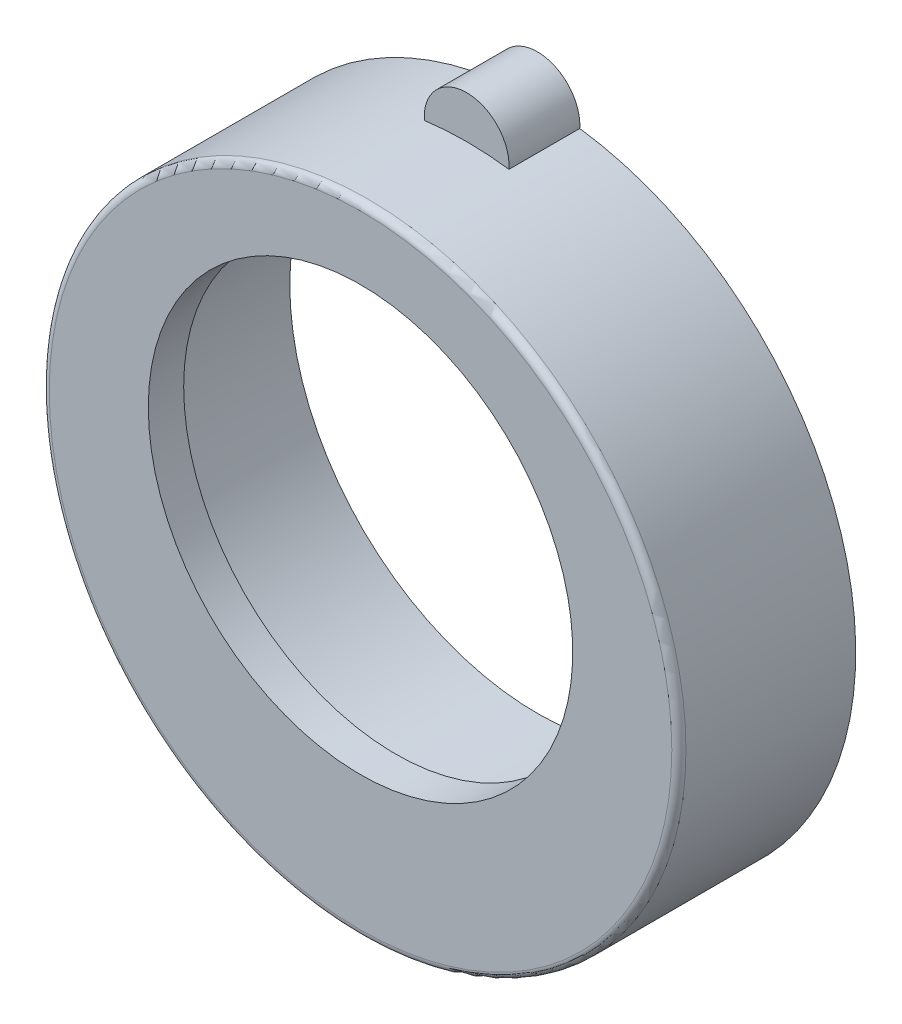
ISO-10303-21;
HEADER;
FILE_DESCRIPTION(('STEP AP214'),'2;1');
FILE_NAME('part.step','',(''),(''),'','','');
FILE_SCHEMA(('AUTOMOTIVE_DESIGN { 1 0 10303 214 1 1 1 1 }'));
ENDSEC;
DATA;
#1=APPLICATION_CONTEXT('core data for automotive mechanical design processes');
#2=APPLICATION_PROTOCOL_DEFINITION('international standard','automotive_design',2000,#1);
#3=PRODUCT_CONTEXT('',#1,'mechanical');
#4=PRODUCT('Part','Part','',(#3));
#5=PRODUCT_RELATED_PRODUCT_CATEGORY('part','',(#4));
#6=PRODUCT_DEFINITION_FORMATION('','',#4);
#7=PRODUCT_DEFINITION_CONTEXT('part definition',#1,'design');
#8=PRODUCT_DEFINITION('design','',#6,#7);
#9=PRODUCT_DEFINITION_SHAPE('','',#8);
#10=(LENGTH_UNIT() NAMED_UNIT(*) SI_UNIT(.MILLI.,.METRE.));
#11=(NAMED_UNIT(*) PLANE_ANGLE_UNIT() SI_UNIT($,.RADIAN.));
#12=(NAMED_UNIT(*) SI_UNIT($,.STERADIAN.) SOLID_ANGLE_UNIT());
#13=UNCERTAINTY_MEASURE_WITH_UNIT(LENGTH_MEASURE(1.E-05),#10,'distance_accuracy_value','');
#14=(GEOMETRIC_REPRESENTATION_CONTEXT(3) GLOBAL_UNCERTAINTY_ASSIGNED_CONTEXT((#13)) GLOBAL_UNIT_ASSIGNED_CONTEXT((#10,
#11,#12)) REPRESENTATION_CONTEXT('',''));
#15=CARTESIAN_POINT('',(0.,0.,0.));
#16=DIRECTION('',(0.,0.,1.));
#17=DIRECTION('',(1.,0.,0.));
#18=AXIS2_PLACEMENT_3D('',#15,#16,#17);
#19=CARTESIAN_POINT('',(0.,0.,5.));
#20=DIRECTION('',(0.,0.,-1.));
#21=DIRECTION('',(-1.,0.,0.));
#22=AXIS2_PLACEMENT_3D('',#19,#20,#21);
#23=CYLINDRICAL_SURFACE('',#22,9.);
#24=CARTESIAN_POINT('',(0.,0.,4.8));
#25=DIRECTION('',(0.,0.,1.));
#26=DIRECTION('',(1.,0.,0.));
#27=AXIS2_PLACEMENT_3D('',#24,#25,#26);
#28=CIRCLE('',#27,9.);
#29=CARTESIAN_POINT('',(9.,0.,4.8));
#30=VERTEX_POINT('',#29);
#31=EDGE_CURVE('E11',#30,#30,#28,.F.);
#32=ORIENTED_EDGE('',*,*,#31,.T.);
#33=EDGE_LOOP('',(#32));
#34=FACE_BOUND('',#33,.T.);
#35=CARTESIAN_POINT('',(0.,0.,0.));
#36=DIRECTION('',(0.,0.,1.));
#37=DIRECTION('',(1.,0.,0.));
#38=AXIS2_PLACEMENT_3D('',#35,#36,#37);
#39=CIRCLE('',#38,9.);
#40=CARTESIAN_POINT('',(-1.19733036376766,8.92,0.));
#41=VERTEX_POINT('',#40);
#42=CARTESIAN_POINT('',(1.19733036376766,8.92,0.));
#43=VERTEX_POINT('',#42);
#44=EDGE_CURVE('E377',#41,#43,#39,.T.);
#45=ORIENTED_EDGE('',*,*,#44,.T.);
#46=DIRECTION('',(0.,0.,-1.));
#47=VECTOR('',#46,1.);
#48=CARTESIAN_POINT('',(1.19733036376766,8.92,2.));
#49=LINE('',#48,#47);
#50=CARTESIAN_POINT('',(1.19733036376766,8.92,2.));
#51=VERTEX_POINT('',#50);
#52=EDGE_CURVE('E364',#51,#43,#49,.T.);
#53=ORIENTED_EDGE('',*,*,#52,.F.);
#54=CARTESIAN_POINT('',(0.,0.,2.));
#55=DIRECTION('',(0.,0.,1.));
#56=DIRECTION('',(-1.,0.,0.));
#57=AXIS2_PLACEMENT_3D('',#54,#55,#56);
#58=CIRCLE('',#57,9.);
#59=CARTESIAN_POINT('',(-1.19733036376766,8.92,2.));
#60=VERTEX_POINT('',#59);
#61=EDGE_CURVE('E369',#51,#60,#58,.T.);
#62=ORIENTED_EDGE('',*,*,#61,.T.);
#63=DIRECTION('',(0.,0.,-1.));
#64=VECTOR('',#63,1.);
#65=CARTESIAN_POINT('',(-1.19733036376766,8.92,2.));
#66=LINE('',#65,#64);
#67=EDGE_CURVE('E381',#60,#41,#66,.T.);
#68=ORIENTED_EDGE('',*,*,#67,.T.);
#69=EDGE_LOOP('',(#45,#53,#62,#68));
#70=FACE_BOUND('',#69,.T.);
#71=ADVANCED_FACE('F350',(#34,#70),#23,.T.);
#72=CARTESIAN_POINT('',(0.,0.,5.));
#73=DIRECTION('',(0.,0.,1.));
#74=DIRECTION('',(1.,0.,0.));
#75=AXIS2_PLACEMENT_3D('',#72,#73,#74);
#76=PLANE('',#75);
#77=CARTESIAN_POINT('',(0.,0.,5.));
#78=DIRECTION('',(0.,0.,1.));
#79=DIRECTION('',(1.,0.,0.));
#80=AXIS2_PLACEMENT_3D('',#77,#78,#79);
#81=CIRCLE('',#80,8.8);
#82=CARTESIAN_POINT('',(8.8,0.,5.));
#83=VERTEX_POINT('',#82);
#84=EDGE_CURVE('E357',#83,#83,#81,.T.);
#85=ORIENTED_EDGE('',*,*,#84,.T.);
#86=EDGE_LOOP('',(#85));
#87=FACE_BOUND('',#86,.T.);
#88=CARTESIAN_POINT('',(0.,1.,5.));
#89=DIRECTION('',(0.,0.,-1.));
#90=DIRECTION('',(-1.,0.,0.));
#91=AXIS2_PLACEMENT_3D('',#88,#89,#90);
#92=CIRCLE('',#91,6.);
#93=CARTESIAN_POINT('',(-6.,1.,5.));
#94=VERTEX_POINT('',#93);
#95=EDGE_CURVE('E448',#94,#94,#92,.T.);
#96=ORIENTED_EDGE('',*,*,#95,.T.);
#97=EDGE_LOOP('',(#96));
#98=FACE_BOUND('',#97,.T.);
#99=ADVANCED_FACE('F400',(#87,#98),#76,.T.);
#100=CARTESIAN_POINT('',(0.,0.,0.));
#101=DIRECTION('',(0.,0.,1.));
#102=DIRECTION('',(1.,0.,0.));
#103=AXIS2_PLACEMENT_3D('',#100,#101,#102);
#104=PLANE('',#103);
#105=CARTESIAN_POINT('',(0.,1.,0.));
#106=DIRECTION('',(0.,0.,-1.));
#107=DIRECTION('',(-1.,0.,0.));
#108=AXIS2_PLACEMENT_3D('',#105,#106,#107);
#109=CIRCLE('',#108,7.);
#110=CARTESIAN_POINT('',(-7.,1.,0.));
#111=VERTEX_POINT('',#110);
#112=EDGE_CURVE('E392',#111,#111,#109,.T.);
#113=ORIENTED_EDGE('',*,*,#112,.F.);
#114=EDGE_LOOP('',(#113));
#115=FACE_BOUND('',#114,.T.);
#116=ORIENTED_EDGE('',*,*,#44,.F.);
#117=CARTESIAN_POINT('',(0.,9.,0.));
#118=DIRECTION('',(0.,0.,-1.));
#119=DIRECTION('',(-1.,0.,0.));
#120=AXIS2_PLACEMENT_3D('',#117,#118,#119);
#121=CIRCLE('',#120,1.2);
#122=EDGE_CURVE('E380',#41,#43,#121,.T.);
#123=ORIENTED_EDGE('',*,*,#122,.T.);
#124=EDGE_LOOP('',(#116,#123));
#125=FACE_BOUND('',#124,.T.);
#126=ADVANCED_FACE('F378',(#115,#125),#104,.F.);
#127=CARTESIAN_POINT('',(0.,9.,2.));
#128=DIRECTION('',(0.,0.,-1.));
#129=DIRECTION('',(-1.,0.,0.));
#130=AXIS2_PLACEMENT_3D('',#127,#128,#129);
#131=CYLINDRICAL_SURFACE('',#130,1.2);
#132=ORIENTED_EDGE('',*,*,#122,.F.);
#133=ORIENTED_EDGE('',*,*,#67,.F.);
#134=CARTESIAN_POINT('',(0.,9.,2.));
#135=DIRECTION('',(0.,0.,-1.));
#136=DIRECTION('',(-1.,0.,0.));
#137=AXIS2_PLACEMENT_3D('',#134,#135,#136);
#138=CIRCLE('',#137,1.2);
#139=EDGE_CURVE('E387',#60,#51,#138,.T.);
#140=ORIENTED_EDGE('',*,*,#139,.T.);
#141=ORIENTED_EDGE('',*,*,#52,.T.);
#142=EDGE_LOOP('',(#132,#133,#140,#141));
#143=FACE_BOUND('',#142,.T.);
#144=ADVANCED_FACE('F386',(#143),#131,.T.);
#145=CARTESIAN_POINT('',(0.,4.5,2.));
#146=DIRECTION('',(0.,0.,-1.));
#147=DIRECTION('',(-1.,0.,0.));
#148=AXIS2_PLACEMENT_3D('',#145,#146,#147);
#149=PLANE('',#148);
#150=ORIENTED_EDGE('',*,*,#139,.F.);
#151=ORIENTED_EDGE('',*,*,#61,.F.);
#152=EDGE_LOOP('',(#150,#151));
#153=FACE_BOUND('',#152,.T.);
#154=ADVANCED_FACE('F428',(#153),#149,.F.);
#155=CARTESIAN_POINT('',(0.,1.,4.));
#156=DIRECTION('',(0.,0.,-1.));
#157=DIRECTION('',(-1.,0.,0.));
#158=AXIS2_PLACEMENT_3D('',#155,#156,#157);
#159=CYLINDRICAL_SURFACE('',#158,7.);
#160=CARTESIAN_POINT('',(0.,1.,4.));
#161=DIRECTION('',(0.,0.,-1.));
#162=DIRECTION('',(-1.,0.,0.));
#163=AXIS2_PLACEMENT_3D('',#160,#161,#162);
#164=CIRCLE('',#163,7.);
#165=CARTESIAN_POINT('',(-7.,1.,4.));
#166=VERTEX_POINT('',#165);
#167=EDGE_CURVE('E388',#166,#166,#164,.T.);
#168=ORIENTED_EDGE('',*,*,#167,.F.);
#169=EDGE_LOOP('',(#168));
#170=FACE_BOUND('',#169,.T.);
#171=ORIENTED_EDGE('',*,*,#112,.T.);
#172=EDGE_LOOP('',(#171));
#173=FACE_BOUND('',#172,.T.);
#174=ADVANCED_FACE('F431',(#170,#173),#159,.F.);
#175=CARTESIAN_POINT('',(0.,1.,4.));
#176=DIRECTION('',(0.,0.,-1.));
#177=DIRECTION('',(-1.,0.,0.));
#178=AXIS2_PLACEMENT_3D('',#175,#176,#177);
#179=PLANE('',#178);
#180=CARTESIAN_POINT('',(0.,1.,4.));
#181=DIRECTION('',(0.,0.,-1.));
#182=DIRECTION('',(-1.,0.,0.));
#183=AXIS2_PLACEMENT_3D('',#180,#181,#182);
#184=CIRCLE('',#183,6.);
#185=CARTESIAN_POINT('',(-6.,1.,4.));
#186=VERTEX_POINT('',#185);
#187=EDGE_CURVE('E443',#186,#186,#184,.T.);
#188=ORIENTED_EDGE('',*,*,#187,.F.);
#189=EDGE_LOOP('',(#188));
#190=FACE_BOUND('',#189,.T.);
#191=ORIENTED_EDGE('',*,*,#167,.T.);
#192=EDGE_LOOP('',(#191));
#193=FACE_BOUND('',#192,.T.);
#194=ADVANCED_FACE('F411',(#190,#193),#179,.T.);
#195=CARTESIAN_POINT('',(0.,1.,5.));
#196=DIRECTION('',(0.,0.,-1.));
#197=DIRECTION('',(-1.,0.,0.));
#198=AXIS2_PLACEMENT_3D('',#195,#196,#197);
#199=CYLINDRICAL_SURFACE('',#198,6.);
#200=ORIENTED_EDGE('',*,*,#95,.F.);
#201=EDGE_LOOP('',(#200));
#202=FACE_BOUND('',#201,.T.);
#203=ORIENTED_EDGE('',*,*,#187,.T.);
#204=EDGE_LOOP('',(#203));
#205=FACE_BOUND('',#204,.T.);
#206=ADVANCED_FACE('F405',(#202,#205),#199,.F.);
#207=CARTESIAN_POINT('',(0.,0.,4.8));
#208=DIRECTION('',(0.,0.,1.));
#209=DIRECTION('',(1.,0.,0.));
#210=AXIS2_PLACEMENT_3D('',#207,#208,#209);
#211=TOROIDAL_SURFACE('',#210,8.8,0.2);
#212=ORIENTED_EDGE('',*,*,#31,.F.);
#213=EDGE_LOOP('',(#212));
#214=FACE_BOUND('',#213,.T.);
#215=ORIENTED_EDGE('',*,*,#84,.F.);
#216=EDGE_LOOP('',(#215));
#217=FACE_BOUND('',#216,.T.);
#218=ADVANCED_FACE('F403',(#214,#217),#211,.T.);
#219=CLOSED_SHELL('',(#71,#99,#126,#144,#154,#174,#194,#206,#218));
#220=MANIFOLD_SOLID_BREP('B2',#219);
#221=ADVANCED_BREP_SHAPE_REPRESENTATION('',(#18,#220),#14);
#222=SHAPE_DEFINITION_REPRESENTATION(#9,#221);
ENDSEC;
END-ISO-10303-21;
